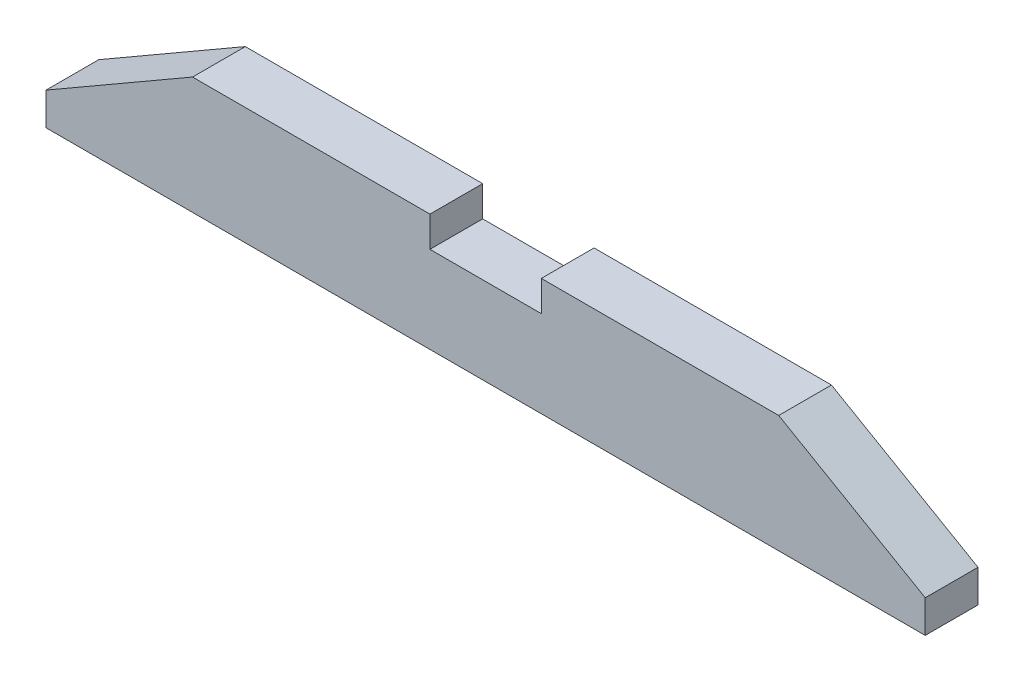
ISO-10303-21;
HEADER;
FILE_DESCRIPTION(('STEP AP214'),'2;1');
FILE_NAME('part.step','',(''),(''),'','','');
FILE_SCHEMA(('AUTOMOTIVE_DESIGN { 1 0 10303 214 1 1 1 1 }'));
ENDSEC;
DATA;
#1=APPLICATION_CONTEXT('core data for automotive mechanical design processes');
#2=APPLICATION_PROTOCOL_DEFINITION('international standard','automotive_design',2000,#1);
#3=PRODUCT_CONTEXT('',#1,'mechanical');
#4=PRODUCT('Part','Part','',(#3));
#5=PRODUCT_RELATED_PRODUCT_CATEGORY('part','',(#4));
#6=PRODUCT_DEFINITION_FORMATION('','',#4);
#7=PRODUCT_DEFINITION_CONTEXT('part definition',#1,'design');
#8=PRODUCT_DEFINITION('design','',#6,#7);
#9=PRODUCT_DEFINITION_SHAPE('','',#8);
#10=(LENGTH_UNIT() NAMED_UNIT(*) SI_UNIT(.MILLI.,.METRE.));
#11=(NAMED_UNIT(*) PLANE_ANGLE_UNIT() SI_UNIT($,.RADIAN.));
#12=(NAMED_UNIT(*) SI_UNIT($,.STERADIAN.) SOLID_ANGLE_UNIT());
#13=UNCERTAINTY_MEASURE_WITH_UNIT(LENGTH_MEASURE(1.E-05),#10,'distance_accuracy_value','');
#14=(GEOMETRIC_REPRESENTATION_CONTEXT(3) GLOBAL_UNCERTAINTY_ASSIGNED_CONTEXT((#13)) GLOBAL_UNIT_ASSIGNED_CONTEXT((#10,
#11,#12)) REPRESENTATION_CONTEXT('',''));
#15=CARTESIAN_POINT('',(0.,0.,0.));
#16=DIRECTION('',(0.,0.,1.));
#17=DIRECTION('',(1.,0.,0.));
#18=AXIS2_PLACEMENT_3D('',#15,#16,#17);
#19=CARTESIAN_POINT('',(19.,-581.211593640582,18.));
#20=DIRECTION('',(1.,0.,0.));
#21=DIRECTION('',(0.,1.,0.));
#22=AXIS2_PLACEMENT_3D('',#19,#20,#21);
#23=PLANE('',#22);
#24=DIRECTION('',(0.,-1.,0.));
#25=VECTOR('',#24,1.);
#26=CARTESIAN_POINT('',(19.,-581.211593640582,0.));
#27=LINE('',#26,#25);
#28=CARTESIAN_POINT('',(19.,-581.211593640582,0.));
#29=VERTEX_POINT('',#28);
#30=CARTESIAN_POINT('',(19.,-591.624690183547,0.));
#31=VERTEX_POINT('',#30);
#32=EDGE_CURVE('E136',#29,#31,#27,.T.);
#33=ORIENTED_EDGE('',*,*,#32,.T.);
#34=DIRECTION('',(0.,0.,-1.));
#35=VECTOR('',#34,1.);
#36=CARTESIAN_POINT('',(19.,-591.624690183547,18.));
#37=LINE('',#36,#35);
#38=CARTESIAN_POINT('',(19.,-591.624690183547,18.));
#39=VERTEX_POINT('',#38);
#40=EDGE_CURVE('E117',#39,#31,#37,.T.);
#41=ORIENTED_EDGE('',*,*,#40,.F.);
#42=DIRECTION('',(0.,-1.,0.));
#43=VECTOR('',#42,1.);
#44=CARTESIAN_POINT('',(19.,-581.211593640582,18.));
#45=LINE('',#44,#43);
#46=CARTESIAN_POINT('',(19.,-581.211593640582,18.));
#47=VERTEX_POINT('',#46);
#48=EDGE_CURVE('E124',#47,#39,#45,.T.);
#49=ORIENTED_EDGE('',*,*,#48,.F.);
#50=DIRECTION('',(0.,0.,-1.));
#51=VECTOR('',#50,1.);
#52=CARTESIAN_POINT('',(19.,-581.211593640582,18.));
#53=LINE('',#52,#51);
#54=EDGE_CURVE('E166',#47,#29,#53,.T.);
#55=ORIENTED_EDGE('',*,*,#54,.T.);
#56=EDGE_LOOP('',(#33,#41,#49,#55));
#57=FACE_BOUND('',#56,.T.);
#58=ADVANCED_FACE('F35',(#57),#23,.F.);
#59=CARTESIAN_POINT('',(-19.,-591.624690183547,18.));
#60=DIRECTION('',(0.,-1.,0.));
#61=DIRECTION('',(0.,0.,-1.));
#62=AXIS2_PLACEMENT_3D('',#59,#60,#61);
#63=PLANE('',#62);
#64=DIRECTION('',(-1.,0.,0.));
#65=VECTOR('',#64,1.);
#66=CARTESIAN_POINT('',(-19.,-591.624690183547,0.));
#67=LINE('',#66,#65);
#68=CARTESIAN_POINT('',(-19.,-591.624690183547,0.));
#69=VERTEX_POINT('',#68);
#70=EDGE_CURVE('E191',#31,#69,#67,.T.);
#71=ORIENTED_EDGE('',*,*,#70,.T.);
#72=DIRECTION('',(0.,0.,-1.));
#73=VECTOR('',#72,1.);
#74=CARTESIAN_POINT('',(-19.,-591.624690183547,18.));
#75=LINE('',#74,#73);
#76=CARTESIAN_POINT('',(-19.,-591.624690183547,18.));
#77=VERTEX_POINT('',#76);
#78=EDGE_CURVE('E120',#77,#69,#75,.T.);
#79=ORIENTED_EDGE('',*,*,#78,.F.);
#80=DIRECTION('',(-1.,0.,0.));
#81=VECTOR('',#80,1.);
#82=CARTESIAN_POINT('',(-19.,-591.624690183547,18.));
#83=LINE('',#82,#81);
#84=EDGE_CURVE('E113',#39,#77,#83,.T.);
#85=ORIENTED_EDGE('',*,*,#84,.F.);
#86=ORIENTED_EDGE('',*,*,#40,.T.);
#87=EDGE_LOOP('',(#71,#79,#85,#86));
#88=FACE_BOUND('',#87,.T.);
#89=ADVANCED_FACE('F115',(#88),#63,.F.);
#90=CARTESIAN_POINT('',(-19.,-581.211593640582,18.));
#91=DIRECTION('',(-1.,0.,0.));
#92=DIRECTION('',(0.,-1.,0.));
#93=AXIS2_PLACEMENT_3D('',#90,#91,#92);
#94=PLANE('',#93);
#95=DIRECTION('',(0.,1.,0.));
#96=VECTOR('',#95,1.);
#97=CARTESIAN_POINT('',(-19.,-581.211593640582,0.));
#98=LINE('',#97,#96);
#99=CARTESIAN_POINT('',(-19.,-581.211593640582,0.));
#100=VERTEX_POINT('',#99);
#101=EDGE_CURVE('E186',#69,#100,#98,.T.);
#102=ORIENTED_EDGE('',*,*,#101,.T.);
#103=DIRECTION('',(0.,0.,-1.));
#104=VECTOR('',#103,1.);
#105=CARTESIAN_POINT('',(-19.,-581.211593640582,18.));
#106=LINE('',#105,#104);
#107=CARTESIAN_POINT('',(-19.,-581.211593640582,18.));
#108=VERTEX_POINT('',#107);
#109=EDGE_CURVE('E142',#108,#100,#106,.T.);
#110=ORIENTED_EDGE('',*,*,#109,.F.);
#111=DIRECTION('',(0.,1.,0.));
#112=VECTOR('',#111,1.);
#113=CARTESIAN_POINT('',(-19.,-581.211593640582,18.));
#114=LINE('',#113,#112);
#115=EDGE_CURVE('E123',#77,#108,#114,.T.);
#116=ORIENTED_EDGE('',*,*,#115,.F.);
#117=ORIENTED_EDGE('',*,*,#78,.T.);
#118=EDGE_LOOP('',(#102,#110,#116,#117));
#119=FACE_BOUND('',#118,.T.);
#120=ADVANCED_FACE('F209',(#119),#94,.F.);
#121=CARTESIAN_POINT('',(-19.,-581.211593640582,18.));
#122=DIRECTION('',(0.,-1.,0.));
#123=DIRECTION('',(0.,0.,-1.));
#124=AXIS2_PLACEMENT_3D('',#121,#122,#123);
#125=PLANE('',#124);
#126=DIRECTION('',(-1.,0.,0.));
#127=VECTOR('',#126,1.);
#128=CARTESIAN_POINT('',(-19.,-581.211593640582,0.));
#129=LINE('',#128,#127);
#130=CARTESIAN_POINT('',(-99.9999999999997,-581.211593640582,0.));
#131=VERTEX_POINT('',#130);
#132=EDGE_CURVE('E180',#100,#131,#129,.T.);
#133=ORIENTED_EDGE('',*,*,#132,.T.);
#134=DIRECTION('',(0.,0.,1.));
#135=VECTOR('',#134,1.);
#136=CARTESIAN_POINT('',(-99.9999999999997,-581.211593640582,18.));
#137=LINE('',#136,#135);
#138=CARTESIAN_POINT('',(-99.9999999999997,-581.211593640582,18.));
#139=VERTEX_POINT('',#138);
#140=EDGE_CURVE('E147',#131,#139,#137,.T.);
#141=ORIENTED_EDGE('',*,*,#140,.T.);
#142=DIRECTION('',(-1.,0.,0.));
#143=VECTOR('',#142,1.);
#144=CARTESIAN_POINT('',(-19.,-581.211593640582,18.));
#145=LINE('',#144,#143);
#146=EDGE_CURVE('E183',#108,#139,#145,.T.);
#147=ORIENTED_EDGE('',*,*,#146,.F.);
#148=ORIENTED_EDGE('',*,*,#109,.T.);
#149=EDGE_LOOP('',(#133,#141,#147,#148));
#150=FACE_BOUND('',#149,.T.);
#151=ADVANCED_FACE('F179',(#150),#125,.F.);
#152=CARTESIAN_POINT('',(-150.,-581.211593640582,18.));
#153=DIRECTION('',(1.,0.,0.));
#154=DIRECTION('',(0.,1.,0.));
#155=AXIS2_PLACEMENT_3D('',#152,#153,#154);
#156=PLANE('',#155);
#157=DIRECTION('',(0.,-1.,0.));
#158=VECTOR('',#157,1.);
#159=CARTESIAN_POINT('',(-150.,-581.211593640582,18.));
#160=LINE('',#159,#158);
#161=CARTESIAN_POINT('',(-150.,-610.079107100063,18.));
#162=VERTEX_POINT('',#161);
#163=CARTESIAN_POINT('',(-150.,-621.211593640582,18.));
#164=VERTEX_POINT('',#163);
#165=EDGE_CURVE('E205',#162,#164,#160,.T.);
#166=ORIENTED_EDGE('',*,*,#165,.F.);
#167=DIRECTION('',(0.,0.,-1.));
#168=VECTOR('',#167,1.);
#169=CARTESIAN_POINT('',(-150.,-610.079107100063,18.));
#170=LINE('',#169,#168);
#171=CARTESIAN_POINT('',(-150.,-610.079107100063,0.));
#172=VERTEX_POINT('',#171);
#173=EDGE_CURVE('E137',#162,#172,#170,.T.);
#174=ORIENTED_EDGE('',*,*,#173,.T.);
#175=DIRECTION('',(0.,-1.,0.));
#176=VECTOR('',#175,1.);
#177=CARTESIAN_POINT('',(-150.,-581.211593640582,0.));
#178=LINE('',#177,#176);
#179=CARTESIAN_POINT('',(-150.,-621.211593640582,0.));
#180=VERTEX_POINT('',#179);
#181=EDGE_CURVE('E188',#172,#180,#178,.T.);
#182=ORIENTED_EDGE('',*,*,#181,.T.);
#183=DIRECTION('',(0.,0.,-1.));
#184=VECTOR('',#183,1.);
#185=CARTESIAN_POINT('',(-150.,-621.211593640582,18.));
#186=LINE('',#185,#184);
#187=EDGE_CURVE('E171',#164,#180,#186,.T.);
#188=ORIENTED_EDGE('',*,*,#187,.F.);
#189=EDGE_LOOP('',(#166,#174,#182,#188));
#190=FACE_BOUND('',#189,.T.);
#191=ADVANCED_FACE('F216',(#190),#156,.F.);
#192=CARTESIAN_POINT('',(-150.,-621.211593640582,18.));
#193=DIRECTION('',(0.,1.,0.));
#194=DIRECTION('',(0.,0.,1.));
#195=AXIS2_PLACEMENT_3D('',#192,#193,#194);
#196=PLANE('',#195);
#197=DIRECTION('',(1.,0.,0.));
#198=VECTOR('',#197,1.);
#199=CARTESIAN_POINT('',(-150.,-621.211593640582,0.));
#200=LINE('',#199,#198);
#201=CARTESIAN_POINT('',(150.,-621.211593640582,0.));
#202=VERTEX_POINT('',#201);
#203=EDGE_CURVE('E162',#180,#202,#200,.T.);
#204=ORIENTED_EDGE('',*,*,#203,.T.);
#205=DIRECTION('',(0.,0.,-1.));
#206=VECTOR('',#205,1.);
#207=CARTESIAN_POINT('',(150.,-621.211593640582,18.));
#208=LINE('',#207,#206);
#209=CARTESIAN_POINT('',(150.,-621.211593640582,18.));
#210=VERTEX_POINT('',#209);
#211=EDGE_CURVE('E168',#210,#202,#208,.T.);
#212=ORIENTED_EDGE('',*,*,#211,.F.);
#213=DIRECTION('',(1.,0.,0.));
#214=VECTOR('',#213,1.);
#215=CARTESIAN_POINT('',(-150.,-621.211593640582,18.));
#216=LINE('',#215,#214);
#217=EDGE_CURVE('E202',#164,#210,#216,.T.);
#218=ORIENTED_EDGE('',*,*,#217,.F.);
#219=ORIENTED_EDGE('',*,*,#187,.T.);
#220=EDGE_LOOP('',(#204,#212,#218,#219));
#221=FACE_BOUND('',#220,.T.);
#222=ADVANCED_FACE('F197',(#221),#196,.F.);
#223=CARTESIAN_POINT('',(150.,-581.211593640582,18.));
#224=DIRECTION('',(-1.,0.,0.));
#225=DIRECTION('',(0.,-1.,0.));
#226=AXIS2_PLACEMENT_3D('',#223,#224,#225);
#227=PLANE('',#226);
#228=DIRECTION('',(0.,1.,0.));
#229=VECTOR('',#228,1.);
#230=CARTESIAN_POINT('',(150.,-581.211593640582,0.));
#231=LINE('',#230,#229);
#232=CARTESIAN_POINT('',(150.,-610.079107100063,0.));
#233=VERTEX_POINT('',#232);
#234=EDGE_CURVE('E160',#202,#233,#231,.T.);
#235=ORIENTED_EDGE('',*,*,#234,.T.);
#236=DIRECTION('',(0.,0.,1.));
#237=VECTOR('',#236,1.);
#238=CARTESIAN_POINT('',(150.,-610.079107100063,18.));
#239=LINE('',#238,#237);
#240=CARTESIAN_POINT('',(150.,-610.079107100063,18.));
#241=VERTEX_POINT('',#240);
#242=EDGE_CURVE('E44',#233,#241,#239,.T.);
#243=ORIENTED_EDGE('',*,*,#242,.T.);
#244=DIRECTION('',(0.,1.,0.));
#245=VECTOR('',#244,1.);
#246=CARTESIAN_POINT('',(150.,-581.211593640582,18.));
#247=LINE('',#246,#245);
#248=EDGE_CURVE('E201',#210,#241,#247,.T.);
#249=ORIENTED_EDGE('',*,*,#248,.F.);
#250=ORIENTED_EDGE('',*,*,#211,.T.);
#251=EDGE_LOOP('',(#235,#243,#249,#250));
#252=FACE_BOUND('',#251,.T.);
#253=ADVANCED_FACE('F200',(#252),#227,.F.);
#254=CARTESIAN_POINT('',(19.,-581.211593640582,18.));
#255=DIRECTION('',(0.,-1.,0.));
#256=DIRECTION('',(0.,0.,-1.));
#257=AXIS2_PLACEMENT_3D('',#254,#255,#256);
#258=PLANE('',#257);
#259=DIRECTION('',(-1.,0.,0.));
#260=VECTOR('',#259,1.);
#261=CARTESIAN_POINT('',(19.,-581.211593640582,18.));
#262=LINE('',#261,#260);
#263=CARTESIAN_POINT('',(99.9999999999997,-581.211593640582,18.));
#264=VERTEX_POINT('',#263);
#265=EDGE_CURVE('E129',#264,#47,#262,.T.);
#266=ORIENTED_EDGE('',*,*,#265,.F.);
#267=DIRECTION('',(0.,0.,-1.));
#268=VECTOR('',#267,1.);
#269=CARTESIAN_POINT('',(99.9999999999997,-581.211593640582,18.));
#270=LINE('',#269,#268);
#271=CARTESIAN_POINT('',(99.9999999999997,-581.211593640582,0.));
#272=VERTEX_POINT('',#271);
#273=EDGE_CURVE('E151',#264,#272,#270,.T.);
#274=ORIENTED_EDGE('',*,*,#273,.T.);
#275=DIRECTION('',(-1.,0.,0.));
#276=VECTOR('',#275,1.);
#277=CARTESIAN_POINT('',(19.,-581.211593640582,0.));
#278=LINE('',#277,#276);
#279=EDGE_CURVE('E133',#272,#29,#278,.T.);
#280=ORIENTED_EDGE('',*,*,#279,.T.);
#281=ORIENTED_EDGE('',*,*,#54,.F.);
#282=EDGE_LOOP('',(#266,#274,#280,#281));
#283=FACE_BOUND('',#282,.T.);
#284=ADVANCED_FACE('F156',(#283),#258,.F.);
#285=CARTESIAN_POINT('',(0.,0.,18.));
#286=DIRECTION('',(0.,0.,1.));
#287=DIRECTION('',(1.,0.,0.));
#288=AXIS2_PLACEMENT_3D('',#285,#286,#287);
#289=PLANE('',#288);
#290=ORIENTED_EDGE('',*,*,#248,.T.);
#291=DIRECTION('',(0.86602540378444,-0.499999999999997,0.));
#292=VECTOR('',#291,1.);
#293=CARTESIAN_POINT('',(-226.67200253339,-392.607425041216,18.));
#294=LINE('',#293,#292);
#295=EDGE_CURVE('E11',#241,#264,#294,.F.);
#296=ORIENTED_EDGE('',*,*,#295,.T.);
#297=ORIENTED_EDGE('',*,*,#265,.T.);
#298=ORIENTED_EDGE('',*,*,#48,.T.);
#299=ORIENTED_EDGE('',*,*,#84,.T.);
#300=ORIENTED_EDGE('',*,*,#115,.T.);
#301=ORIENTED_EDGE('',*,*,#146,.T.);
#302=DIRECTION('',(0.86602540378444,0.499999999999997,0.));
#303=VECTOR('',#302,1.);
#304=CARTESIAN_POINT('',(226.67200253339,-392.607425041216,18.));
#305=LINE('',#304,#303);
#306=EDGE_CURVE('E149',#139,#162,#305,.F.);
#307=ORIENTED_EDGE('',*,*,#306,.T.);
#308=ORIENTED_EDGE('',*,*,#165,.T.);
#309=ORIENTED_EDGE('',*,*,#217,.T.);
#310=EDGE_LOOP('',(#290,#296,#297,#298,#299,#300,#301,#307,#308,#309));
#311=FACE_BOUND('',#310,.T.);
#312=ADVANCED_FACE('F127',(#311),#289,.T.);
#313=CARTESIAN_POINT('',(0.,0.,0.));
#314=DIRECTION('',(0.,0.,1.));
#315=DIRECTION('',(1.,0.,0.));
#316=AXIS2_PLACEMENT_3D('',#313,#314,#315);
#317=PLANE('',#316);
#318=ORIENTED_EDGE('',*,*,#279,.F.);
#319=DIRECTION('',(-0.86602540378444,0.499999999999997,0.));
#320=VECTOR('',#319,1.);
#321=CARTESIAN_POINT('',(99.9999999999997,-581.211593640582,0.));
#322=LINE('',#321,#320);
#323=EDGE_CURVE('E58',#272,#233,#322,.F.);
#324=ORIENTED_EDGE('',*,*,#323,.T.);
#325=ORIENTED_EDGE('',*,*,#234,.F.);
#326=ORIENTED_EDGE('',*,*,#203,.F.);
#327=ORIENTED_EDGE('',*,*,#181,.F.);
#328=DIRECTION('',(-0.86602540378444,-0.499999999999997,0.));
#329=VECTOR('',#328,1.);
#330=CARTESIAN_POINT('',(-150.,-610.079107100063,0.));
#331=LINE('',#330,#329);
#332=EDGE_CURVE('E140',#172,#131,#331,.F.);
#333=ORIENTED_EDGE('',*,*,#332,.T.);
#334=ORIENTED_EDGE('',*,*,#132,.F.);
#335=ORIENTED_EDGE('',*,*,#101,.F.);
#336=ORIENTED_EDGE('',*,*,#70,.F.);
#337=ORIENTED_EDGE('',*,*,#32,.F.);
#338=EDGE_LOOP('',(#318,#324,#325,#326,#327,#333,#334,#335,#336,#337));
#339=FACE_BOUND('',#338,.T.);
#340=ADVANCED_FACE('F159',(#339),#317,.F.);
#341=CARTESIAN_POINT('',(-150.,-610.079107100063,18.));
#342=DIRECTION('',(0.499999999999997,-0.86602540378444,0.));
#343=DIRECTION('',(0.,0.,-1.));
#344=AXIS2_PLACEMENT_3D('',#341,#342,#343);
#345=PLANE('',#344);
#346=ORIENTED_EDGE('',*,*,#306,.F.);
#347=ORIENTED_EDGE('',*,*,#140,.F.);
#348=ORIENTED_EDGE('',*,*,#332,.F.);
#349=ORIENTED_EDGE('',*,*,#173,.F.);
#350=EDGE_LOOP('',(#346,#347,#348,#349));
#351=FACE_BOUND('',#350,.T.);
#352=ADVANCED_FACE('F218',(#351),#345,.F.);
#353=CARTESIAN_POINT('',(99.9999999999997,-581.211593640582,18.));
#354=DIRECTION('',(-0.499999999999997,-0.86602540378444,0.));
#355=DIRECTION('',(0.,0.,-1.));
#356=AXIS2_PLACEMENT_3D('',#353,#354,#355);
#357=PLANE('',#356);
#358=ORIENTED_EDGE('',*,*,#295,.F.);
#359=ORIENTED_EDGE('',*,*,#242,.F.);
#360=ORIENTED_EDGE('',*,*,#323,.F.);
#361=ORIENTED_EDGE('',*,*,#273,.F.);
#362=EDGE_LOOP('',(#358,#359,#360,#361));
#363=FACE_BOUND('',#362,.T.);
#364=ADVANCED_FACE('F38',(#363),#357,.F.);
#365=CLOSED_SHELL('',(#58,#89,#120,#151,#191,#222,#253,#284,#312,#340,#352,#364));
#366=MANIFOLD_SOLID_BREP('B2',#365);
#367=ADVANCED_BREP_SHAPE_REPRESENTATION('',(#18,#366),#14);
#368=SHAPE_DEFINITION_REPRESENTATION(#9,#367);
ENDSEC;
END-ISO-10303-21;
